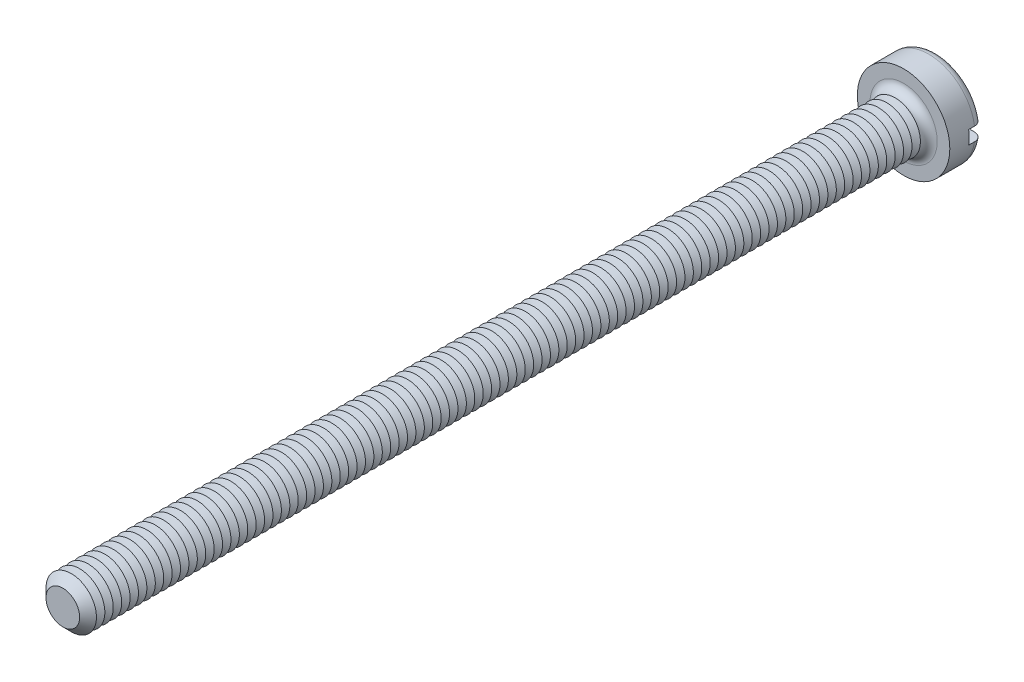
from build123d import *

# Parameters (mm, degrees)
SKETCH3_R           = 2.75
BOSS_EXTRUDE2_DEPTH = 2
SKETCH4_R           = 1.5
BOSS_EXTRUDE3_DEPTH = 50
FILLET1_R           = 0.5
CHAMFER1_SIZE       = 0.5
LPATTERN1_COUNT     = 98
LPATTERN1_PITCH     = 0.5
SKETCH8_W           = 5.5
SKETCH8_H           = 0.8
CUT_EXTRUDE1_DEPTH  = 0.85


with BuildPart() as part:
    # Sketch3 → Boss-Extrude2 (new body)
    with BuildSketch(Plane.XY):
        Circle(SKETCH3_R)
    extrude(amount=-BOSS_EXTRUDE2_DEPTH)

    # Sketch4 → Boss-Extrude3 (add)
    with BuildSketch(Plane.XY):
        Circle(SKETCH4_R)
    extrude(amount=BOSS_EXTRUDE3_DEPTH)

    # Fillet1
    fillet1_edges = [part.edges().sort_by_distance(p)[0] for p in [
        (-2.75, 0, -2),
        (-1.5, 0, 0),
    ]]
    fillet(fillet1_edges, radius=FILLET1_R)

    # Chamfer1
    chamfer1_edges = [part.edges().sort_by_distance(p)[0] for p in [
        (-1.5, 0, 50),
    ]]
    chamfer(chamfer1_edges, length=CHAMFER1_SIZE)

    # Sketch6 → Cut-Revolve1 (revolve, cut)
    with BuildSketch(Plane(origin=(0, 0, 0), x_dir=(0, 0, -1), z_dir=(1, 0, 0)), mode=Mode.PRIVATE) as cut_revolve1_sk:
        Polygon((-0.5, 1.5), (-0.75, 1.066987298), (-1, 1.5), align=None)
    cut_revolve1 = revolve(cut_revolve1_sk.sketch.rotate(Axis((0, 0, -1.694361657), (0, 0, 1)), 90), axis=Axis((0, 0, -1.694361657), (0, 0, 1)), mode=Mode.SUBTRACT)

    # LPattern1: Cut-Revolve1 ×98
    with Locations(*[(0, 0, i * LPATTERN1_PITCH) for i in range(1, LPATTERN1_COUNT)]):
        add(cut_revolve1, mode=Mode.SUBTRACT)

    # Sketch8 → Cut-Extrude1 (cut)
    with BuildSketch(Plane(origin=(0, 0, -2), x_dir=(-1, 0, 0), z_dir=(0, 0, -1))):
        Rectangle(SKETCH8_W, SKETCH8_H)
    extrude(amount=-CUT_EXTRUDE1_DEPTH, mode=Mode.SUBTRACT)


solid = part.part
